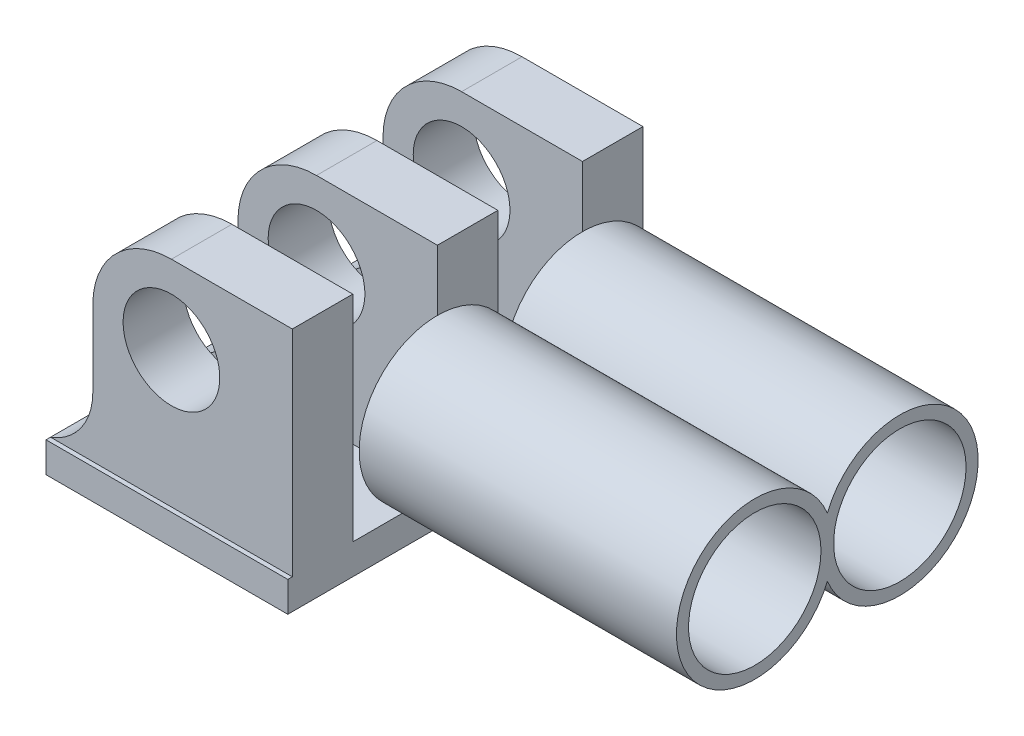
from build123d import *

# Parameters (mm, degrees)
SKETCH1_W                = 101.6
SKETCH1_H                = 152.4
BOSS_EXTRUDE1_DEPTH      = 12.7
BOSS_EXTRUDE2_DEPTH      = 13.335
BOSS_EXTRUDE2_DEPTH_BACK = 12.065
SKETCH2_R                = 20.32
BOSS_EXTRUDE3_START      = 25.4
SKETCH6_R                = 32.901098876
SKETCH6_R_2              = 27.821098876
BOSS_EXTRUDE3_DEPTH      = 133.35
BOSS_EXTRUDE6_START      = -73.025
SKETCH2_6_R              = 20.32
BOSS_EXTRUDE6_DEPTH      = 25.4
BOSS_EXTRUDE7_START      = 48.895
SKETCH2_7_R              = 20.32
BOSS_EXTRUDE7_DEPTH      = 25.4


with BuildPart() as part:
    # Sketch1 → Boss-Extrude1 (new body)
    with BuildSketch(Plane(origin=(0, 0, 0), x_dir=(1, 0, 0), z_dir=(0, 1, 0))):
        Rectangle(SKETCH1_W, SKETCH1_H)
    extrude(amount=-BOSS_EXTRUDE1_DEPTH)

    # Sketch2 → Boss-Extrude2 (add, two sides: drawn at the far end of the back side and taken through both)
    with BuildSketch(Plane.XY.offset(-BOSS_EXTRUDE2_DEPTH_BACK)):
        with BuildLine():
            Line((-33.02, 57.15), (-33.02, 25.4))
            ThreePointArc((-33.02, 25.4), (-37.906677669, 9.897674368), (-50.8, 0))
            Line((-50.8, 0), (50.8, 0))
            Line((50.8, 0), (50.8, 57.15))
            Line((50.8, 57.15), (50.8, 90.17))
            Line((50.8, 90.17), (0, 90.17))
            ThreePointArc((0, 90.17), (-23.348665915, 80.498665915), (-33.02, 57.15))
        make_face()
        with Locations(Location((0, 57.15, 0), (0, 0, 180))):
            Circle(SKETCH2_R, mode=Mode.SUBTRACT)
    extrude(amount=BOSS_EXTRUDE2_DEPTH + BOSS_EXTRUDE2_DEPTH_BACK)

    # Sketch2_6 → Boss-Extrude6 (add)
    with BuildSketch(Plane.XY.offset(BOSS_EXTRUDE6_START)):
        with BuildLine():
            Line((-33.02, 57.15), (-33.02, 25.4))
            ThreePointArc((-33.02, 25.4), (-37.906677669, 9.897674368), (-50.8, 0))
            Line((-50.8, 0), (50.8, 0))
            Line((50.8, 0), (50.8, 57.15))
            Line((50.8, 57.15), (50.8, 90.17))
            Line((50.8, 90.17), (0, 90.17))
            ThreePointArc((0, 90.17), (-23.348665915, 80.498665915), (-33.02, 57.15))
        make_face()
        with Locations(Location((0, 57.15, 0), (0, 0, 180))):
            Circle(SKETCH2_6_R, mode=Mode.SUBTRACT)
    extrude(amount=BOSS_EXTRUDE6_DEPTH)

    # Sketch2_7 → Boss-Extrude7 (add)
    with BuildSketch(Plane.XY.offset(BOSS_EXTRUDE7_START)):
        with BuildLine():
            Line((-33.02, 57.15), (-33.02, 25.4))
            ThreePointArc((-33.02, 25.4), (-37.906677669, 9.897674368), (-50.8, 0))
            Line((-50.8, 0), (50.8, 0))
            Line((50.8, 0), (50.8, 57.15))
            Line((50.8, 57.15), (50.8, 90.17))
            Line((50.8, 90.17), (0, 90.17))
            ThreePointArc((0, 90.17), (-23.348665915, 80.498665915), (-33.02, 57.15))
        make_face()
        with Locations(Location((0, 57.15, 0), (0, 0, 180))):
            Circle(SKETCH2_7_R, mode=Mode.SUBTRACT)
    extrude(amount=BOSS_EXTRUDE7_DEPTH)


with BuildPart() as body_2:
    # Sketch6 → Boss-Extrude3 (new body)
    # profile 1 of 2: a face of its own
    with BuildSketch(Plane(origin=(50.8, 0, 0), x_dir=(0, 0, -1), z_dir=(1, 0, 0)).offset(BOSS_EXTRUDE3_START)):
        with Locations((-38.735, 57.15)):
            Circle(SKETCH6_R)
        with Locations((-38.735, 57.15)):
            Circle(SKETCH6_R_2, mode=Mode.SUBTRACT)
    # profile 2 of 2: a face of its own
    with BuildSketch(Plane(origin=(50.8, 0, 0), x_dir=(0, 0, -1), z_dir=(1, 0, 0)).offset(BOSS_EXTRUDE3_START)):
        with Locations((22.225, 57.15)):
            Circle(SKETCH6_R)
        with Locations((22.225, 57.15)):
            Circle(SKETCH6_R_2, mode=Mode.SUBTRACT)
    extrude(amount=BOSS_EXTRUDE3_DEPTH)


solid = Compound([part.part, body_2.part])
